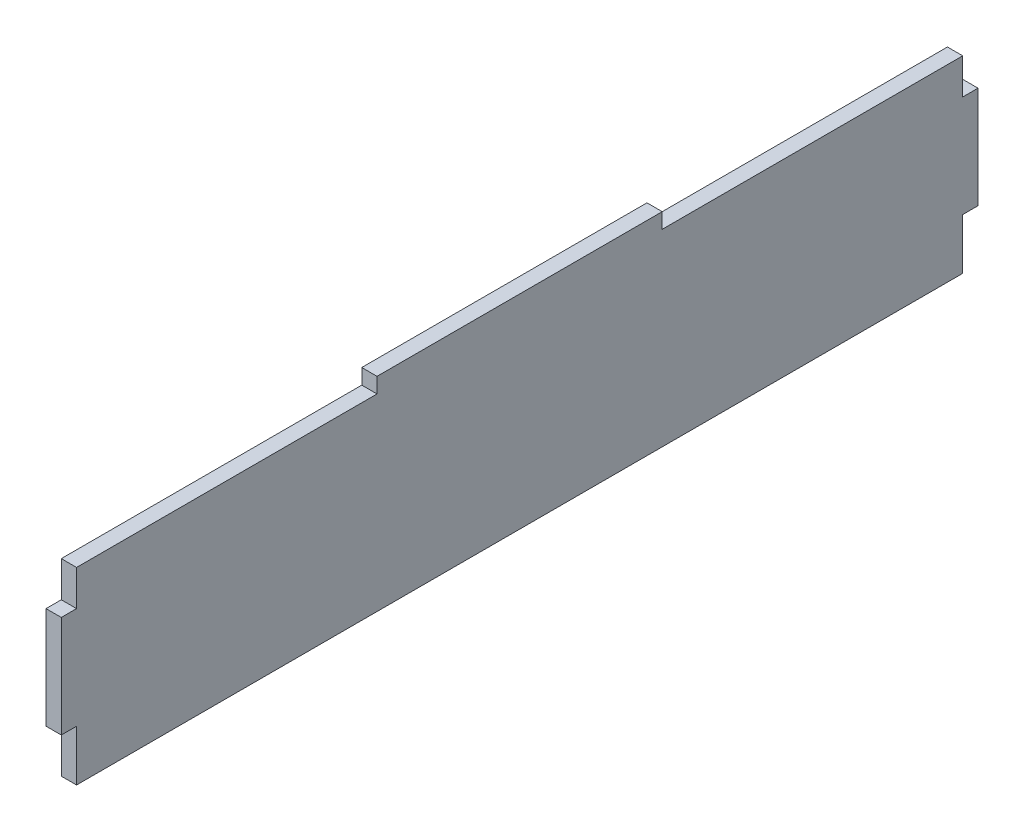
from build123d import *

# Parameters (mm, degrees)
ESQUISSE1_W             = 180
ESQUISSE1_H             = 40
BOSS_EXTRU_1_DEPTH      = 3
ESQUISSE2_W             = 3
ESQUISSE2_H             = 10
ENL_V_MAT_EXTRU_1_DEPTH = 93.244241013


with BuildPart() as part:
    # Esquisse1 → Boss.-Extru.1 (new body)
    with BuildSketch(Plane(origin=(0, 0, 0), x_dir=(0, 0, -1), z_dir=(1, 0, 0))):
        Rectangle(ESQUISSE1_W, ESQUISSE1_H)
    extrude(amount=BOSS_EXTRU_1_DEPTH)

    # Esquisse2 → Enl_v. mat.-Extru.1 (cut, through all)
    with BuildSketch(Plane(origin=(3, 0, 0), x_dir=(0, 0, -1), z_dir=(1, 0, 0))):
        Polygon((-87, 17), (-87, 10), (-90, 10), (-90, 20), (-28, 20), (-28, 17), align=None)
        with Locations((-88.5, -15)):
            Rectangle(ESQUISSE2_W, ESQUISSE2_H)
        Polygon((90, 20), (90, 10), (87, 10), (87, 17), (28, 17), (28, 20), align=None)
        with Locations((88.5, -15)):
            Rectangle(ESQUISSE2_W, ESQUISSE2_H)
    extrude(amount=-ENL_V_MAT_EXTRU_1_DEPTH, mode=Mode.SUBTRACT)


solid = part.part
